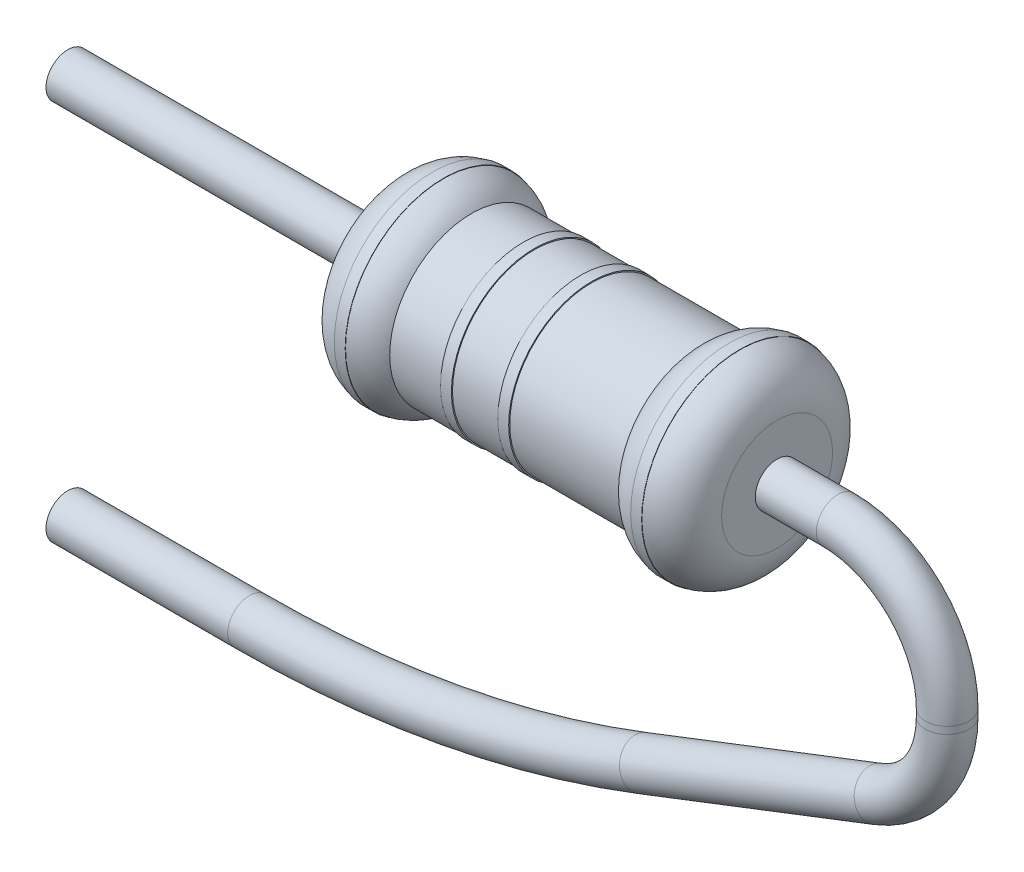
ISO-10303-21;
HEADER;
FILE_DESCRIPTION(('STEP AP214'),'2;1');
FILE_NAME('part.step','',(''),(''),'','','');
FILE_SCHEMA(('AUTOMOTIVE_DESIGN { 1 0 10303 214 1 1 1 1 }'));
ENDSEC;
DATA;
#1=APPLICATION_CONTEXT('core data for automotive mechanical design processes');
#2=APPLICATION_PROTOCOL_DEFINITION('international standard','automotive_design',2000,#1);
#3=PRODUCT_CONTEXT('',#1,'mechanical');
#4=PRODUCT('Part','Part','',(#3));
#5=PRODUCT_RELATED_PRODUCT_CATEGORY('part','',(#4));
#6=PRODUCT_DEFINITION_FORMATION('','',#4);
#7=PRODUCT_DEFINITION_CONTEXT('part definition',#1,'design');
#8=PRODUCT_DEFINITION('design','',#6,#7);
#9=PRODUCT_DEFINITION_SHAPE('','',#8);
#10=(LENGTH_UNIT() NAMED_UNIT(*) SI_UNIT(.MILLI.,.METRE.));
#11=(NAMED_UNIT(*) PLANE_ANGLE_UNIT() SI_UNIT($,.RADIAN.));
#12=(NAMED_UNIT(*) SI_UNIT($,.STERADIAN.) SOLID_ANGLE_UNIT());
#13=UNCERTAINTY_MEASURE_WITH_UNIT(LENGTH_MEASURE(1.E-05),#10,'distance_accuracy_value','');
#14=(GEOMETRIC_REPRESENTATION_CONTEXT(3) GLOBAL_UNCERTAINTY_ASSIGNED_CONTEXT((#13)) GLOBAL_UNIT_ASSIGNED_CONTEXT((#10,
#11,#12)) REPRESENTATION_CONTEXT('',''));
#15=CARTESIAN_POINT('',(0.,0.,0.));
#16=DIRECTION('',(0.,0.,1.));
#17=DIRECTION('',(1.,0.,0.));
#18=AXIS2_PLACEMENT_3D('',#15,#16,#17);
#19=CARTESIAN_POINT('',(1.75000000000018,0.,0.));
#20=DIRECTION('',(-1.,0.,0.));
#21=DIRECTION('',(0.,0.,1.));
#22=AXIS2_PLACEMENT_3D('',#19,#20,#21);
#23=PLANE('',#22);
#24=CARTESIAN_POINT('',(1.75000000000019,0.,0.));
#25=DIRECTION('',(-1.,0.,0.));
#26=DIRECTION('',(0.,0.,1.));
#27=AXIS2_PLACEMENT_3D('',#24,#25,#26);
#28=CIRCLE('',#27,0.508257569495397);
#29=CARTESIAN_POINT('',(1.75000000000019,0.,0.508257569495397));
#30=VERTEX_POINT('',#29);
#31=EDGE_CURVE('E36',#30,#30,#28,.T.);
#32=ORIENTED_EDGE('',*,*,#31,.F.);
#33=EDGE_LOOP('',(#32));
#34=FACE_BOUND('',#33,.T.);
#35=CARTESIAN_POINT('',(1.75000000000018,0.,0.));
#36=DIRECTION('',(1.,0.,0.));
#37=DIRECTION('',(0.,0.,-1.));
#38=AXIS2_PLACEMENT_3D('',#35,#36,#37);
#39=CIRCLE('',#38,0.2);
#40=CARTESIAN_POINT('',(1.75000000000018,0.,-0.2));
#41=VERTEX_POINT('',#40);
#42=EDGE_CURVE('E10',#41,#41,#39,.T.);
#43=ORIENTED_EDGE('',*,*,#42,.F.);
#44=EDGE_LOOP('',(#43));
#45=FACE_BOUND('',#44,.T.);
#46=ADVANCED_FACE('F24',(#34,#45),#23,.F.);
#47=CARTESIAN_POINT('',(-1.75000000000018,0.,0.));
#48=DIRECTION('',(1.,0.,0.));
#49=DIRECTION('',(0.,0.,-1.));
#50=AXIS2_PLACEMENT_3D('',#47,#48,#49);
#51=PLANE('',#50);
#52=CARTESIAN_POINT('',(-1.75000000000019,0.,0.));
#53=DIRECTION('',(-1.,0.,0.));
#54=DIRECTION('',(0.,0.,1.));
#55=AXIS2_PLACEMENT_3D('',#52,#53,#54);
#56=CIRCLE('',#55,0.508257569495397);
#57=CARTESIAN_POINT('',(-1.75000000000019,0.,0.508257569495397));
#58=VERTEX_POINT('',#57);
#59=EDGE_CURVE('E62',#58,#58,#56,.T.);
#60=ORIENTED_EDGE('',*,*,#59,.T.);
#61=EDGE_LOOP('',(#60));
#62=FACE_BOUND('',#61,.T.);
#63=CARTESIAN_POINT('',(-1.75000000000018,0.,0.));
#64=DIRECTION('',(1.,0.,0.));
#65=DIRECTION('',(0.,0.,-1.));
#66=AXIS2_PLACEMENT_3D('',#63,#64,#65);
#67=CIRCLE('',#66,0.2);
#68=CARTESIAN_POINT('',(-1.75000000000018,0.,-0.2));
#69=VERTEX_POINT('',#68);
#70=EDGE_CURVE('E28',#69,#69,#67,.F.);
#71=ORIENTED_EDGE('',*,*,#70,.F.);
#72=EDGE_LOOP('',(#71));
#73=FACE_BOUND('',#72,.T.);
#74=ADVANCED_FACE('F26',(#62,#73),#51,.F.);
#75=CARTESIAN_POINT('',(1.35825756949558,0.,0.));
#76=DIRECTION('',(-1.,0.,0.));
#77=DIRECTION('',(0.,0.,1.));
#78=AXIS2_PLACEMENT_3D('',#75,#76,#77);
#79=TOROIDAL_SURFACE('',#78,0.508257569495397,0.391742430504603);
#80=CARTESIAN_POINT('',(1.40825756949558,0.,0.));
#81=DIRECTION('',(-1.,0.,0.));
#82=DIRECTION('',(0.,0.,1.));
#83=AXIS2_PLACEMENT_3D('',#80,#81,#82);
#84=CIRCLE('',#83,0.896796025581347);
#85=CARTESIAN_POINT('',(1.40825756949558,0.,0.896796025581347));
#86=VERTEX_POINT('',#85);
#87=EDGE_CURVE('E116',#86,#86,#84,.T.);
#88=ORIENTED_EDGE('',*,*,#87,.F.);
#89=EDGE_LOOP('',(#88));
#90=FACE_BOUND('',#89,.T.);
#91=ORIENTED_EDGE('',*,*,#31,.T.);
#92=EDGE_LOOP('',(#91));
#93=FACE_BOUND('',#92,.T.);
#94=ADVANCED_FACE('F121',(#90,#93),#79,.T.);
#95=CARTESIAN_POINT('',(1.40825756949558,0.896796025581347,0.));
#96=DIRECTION('',(-1.,0.,0.));
#97=DIRECTION('',(0.,0.,1.));
#98=AXIS2_PLACEMENT_3D('',#95,#96,#97);
#99=PLANE('',#98);
#100=CARTESIAN_POINT('',(1.40825756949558,0.,0.));
#101=DIRECTION('',(-1.,0.,0.));
#102=DIRECTION('',(0.,0.,1.));
#103=AXIS2_PLACEMENT_3D('',#100,#101,#102);
#104=CIRCLE('',#103,0.900000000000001);
#105=CARTESIAN_POINT('',(1.40825756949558,0.,0.900000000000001));
#106=VERTEX_POINT('',#105);
#107=EDGE_CURVE('E113',#106,#106,#104,.T.);
#108=ORIENTED_EDGE('',*,*,#107,.F.);
#109=EDGE_LOOP('',(#108));
#110=FACE_BOUND('',#109,.T.);
#111=ORIENTED_EDGE('',*,*,#87,.T.);
#112=EDGE_LOOP('',(#111));
#113=FACE_BOUND('',#112,.T.);
#114=ADVANCED_FACE('F134',(#110,#113),#99,.F.);
#115=CARTESIAN_POINT('',(-9.42004899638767,0.,0.));
#116=DIRECTION('',(-1.,0.,0.));
#117=DIRECTION('',(0.,0.,1.));
#118=AXIS2_PLACEMENT_3D('',#115,#116,#117);
#119=CYLINDRICAL_SURFACE('',#118,0.900000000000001);
#120=CARTESIAN_POINT('',(1.30825756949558,0.,0.));
#121=DIRECTION('',(-1.,0.,0.));
#122=DIRECTION('',(0.,0.,1.));
#123=AXIS2_PLACEMENT_3D('',#120,#121,#122);
#124=CIRCLE('',#123,0.900000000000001);
#125=CARTESIAN_POINT('',(1.30825756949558,0.,0.900000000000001));
#126=VERTEX_POINT('',#125);
#127=EDGE_CURVE('E110',#126,#126,#124,.T.);
#128=ORIENTED_EDGE('',*,*,#127,.F.);
#129=EDGE_LOOP('',(#128));
#130=FACE_BOUND('',#129,.T.);
#131=ORIENTED_EDGE('',*,*,#107,.T.);
#132=EDGE_LOOP('',(#131));
#133=FACE_BOUND('',#132,.T.);
#134=ADVANCED_FACE('F138',(#130,#133),#119,.T.);
#135=CARTESIAN_POINT('',(1.30825756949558,0.896796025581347,0.));
#136=DIRECTION('',(1.,0.,0.));
#137=DIRECTION('',(0.,0.,-1.));
#138=AXIS2_PLACEMENT_3D('',#135,#136,#137);
#139=PLANE('',#138);
#140=CARTESIAN_POINT('',(1.30825756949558,0.,0.));
#141=DIRECTION('',(-1.,0.,0.));
#142=DIRECTION('',(0.,0.,1.));
#143=AXIS2_PLACEMENT_3D('',#140,#141,#142);
#144=CIRCLE('',#143,0.896796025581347);
#145=CARTESIAN_POINT('',(1.30825756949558,0.,0.896796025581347));
#146=VERTEX_POINT('',#145);
#147=EDGE_CURVE('E107',#146,#146,#144,.T.);
#148=ORIENTED_EDGE('',*,*,#147,.F.);
#149=EDGE_LOOP('',(#148));
#150=FACE_BOUND('',#149,.T.);
#151=ORIENTED_EDGE('',*,*,#127,.T.);
#152=EDGE_LOOP('',(#151));
#153=FACE_BOUND('',#152,.T.);
#154=ADVANCED_FACE('F142',(#150,#153),#139,.F.);
#155=CARTESIAN_POINT('',(1.35825756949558,0.,0.));
#156=DIRECTION('',(-1.,0.,0.));
#157=DIRECTION('',(0.,0.,1.));
#158=AXIS2_PLACEMENT_3D('',#155,#156,#157);
#159=TOROIDAL_SURFACE('',#158,0.508257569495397,0.391742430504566);
#160=CARTESIAN_POINT('',(1.04999999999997,0.,0.));
#161=DIRECTION('',(-1.,0.,0.));
#162=DIRECTION('',(0.,0.,1.));
#163=AXIS2_PLACEMENT_3D('',#160,#161,#162);
#164=CIRCLE('',#163,0.750000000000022);
#165=CARTESIAN_POINT('',(1.04999999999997,0.,0.750000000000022));
#166=VERTEX_POINT('',#165);
#167=EDGE_CURVE('E104',#166,#166,#164,.T.);
#168=ORIENTED_EDGE('',*,*,#167,.F.);
#169=EDGE_LOOP('',(#168));
#170=FACE_BOUND('',#169,.T.);
#171=ORIENTED_EDGE('',*,*,#147,.T.);
#172=EDGE_LOOP('',(#171));
#173=FACE_BOUND('',#172,.T.);
#174=ADVANCED_FACE('F146',(#170,#173),#159,.T.);
#175=CARTESIAN_POINT('',(-9.42004899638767,0.,0.));
#176=DIRECTION('',(-1.,0.,0.));
#177=DIRECTION('',(0.,0.,1.));
#178=AXIS2_PLACEMENT_3D('',#175,#176,#177);
#179=CYLINDRICAL_SURFACE('',#178,0.750000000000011);
#180=CARTESIAN_POINT('',(0.0499999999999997,0.,0.));
#181=DIRECTION('',(-1.,0.,0.));
#182=DIRECTION('',(0.,0.,1.));
#183=AXIS2_PLACEMENT_3D('',#180,#181,#182);
#184=CIRCLE('',#183,0.75);
#185=CARTESIAN_POINT('',(0.0499999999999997,0.,0.75));
#186=VERTEX_POINT('',#185);
#187=EDGE_CURVE('E101',#186,#186,#184,.T.);
#188=ORIENTED_EDGE('',*,*,#187,.F.);
#189=EDGE_LOOP('',(#188));
#190=FACE_BOUND('',#189,.T.);
#191=ORIENTED_EDGE('',*,*,#167,.T.);
#192=EDGE_LOOP('',(#191));
#193=FACE_BOUND('',#192,.T.);
#194=ADVANCED_FACE('F150',(#190,#193),#179,.T.);
#195=CARTESIAN_POINT('',(0.05,0.75,0.));
#196=DIRECTION('',(-1.,0.,0.));
#197=DIRECTION('',(0.,0.,1.));
#198=AXIS2_PLACEMENT_3D('',#195,#196,#197);
#199=PLANE('',#198);
#200=CARTESIAN_POINT('',(0.0499999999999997,0.,0.));
#201=DIRECTION('',(-1.,0.,0.));
#202=DIRECTION('',(0.,0.,1.));
#203=AXIS2_PLACEMENT_3D('',#200,#201,#202);
#204=CIRCLE('',#203,0.760000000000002);
#205=CARTESIAN_POINT('',(0.0499999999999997,0.,0.760000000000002));
#206=VERTEX_POINT('',#205);
#207=EDGE_CURVE('E98',#206,#206,#204,.T.);
#208=ORIENTED_EDGE('',*,*,#207,.F.);
#209=EDGE_LOOP('',(#208));
#210=FACE_BOUND('',#209,.T.);
#211=ORIENTED_EDGE('',*,*,#187,.T.);
#212=EDGE_LOOP('',(#211));
#213=FACE_BOUND('',#212,.T.);
#214=ADVANCED_FACE('F154',(#210,#213),#199,.F.);
#215=CARTESIAN_POINT('',(-9.42004899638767,0.,0.));
#216=DIRECTION('',(-1.,0.,0.));
#217=DIRECTION('',(0.,0.,1.));
#218=AXIS2_PLACEMENT_3D('',#215,#216,#217);
#219=CYLINDRICAL_SURFACE('',#218,0.760000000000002);
#220=CARTESIAN_POINT('',(-0.0499999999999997,0.,0.));
#221=DIRECTION('',(-1.,0.,0.));
#222=DIRECTION('',(0.,0.,1.));
#223=AXIS2_PLACEMENT_3D('',#220,#221,#222);
#224=CIRCLE('',#223,0.760000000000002);
#225=CARTESIAN_POINT('',(-0.0499999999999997,0.,0.760000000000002));
#226=VERTEX_POINT('',#225);
#227=EDGE_CURVE('E95',#226,#226,#224,.T.);
#228=ORIENTED_EDGE('',*,*,#227,.F.);
#229=EDGE_LOOP('',(#228));
#230=FACE_BOUND('',#229,.T.);
#231=ORIENTED_EDGE('',*,*,#207,.T.);
#232=EDGE_LOOP('',(#231));
#233=FACE_BOUND('',#232,.T.);
#234=ADVANCED_FACE('F158',(#230,#233),#219,.T.);
#235=CARTESIAN_POINT('',(-0.05,0.75,0.));
#236=DIRECTION('',(1.,0.,0.));
#237=DIRECTION('',(0.,0.,-1.));
#238=AXIS2_PLACEMENT_3D('',#235,#236,#237);
#239=PLANE('',#238);
#240=CARTESIAN_POINT('',(-0.0499999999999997,0.,0.));
#241=DIRECTION('',(-1.,0.,0.));
#242=DIRECTION('',(0.,0.,1.));
#243=AXIS2_PLACEMENT_3D('',#240,#241,#242);
#244=CIRCLE('',#243,0.75);
#245=CARTESIAN_POINT('',(-0.0499999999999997,0.,0.75));
#246=VERTEX_POINT('',#245);
#247=EDGE_CURVE('E92',#246,#246,#244,.T.);
#248=ORIENTED_EDGE('',*,*,#247,.F.);
#249=EDGE_LOOP('',(#248));
#250=FACE_BOUND('',#249,.T.);
#251=ORIENTED_EDGE('',*,*,#227,.T.);
#252=EDGE_LOOP('',(#251));
#253=FACE_BOUND('',#252,.T.);
#254=ADVANCED_FACE('F162',(#250,#253),#239,.F.);
#255=CARTESIAN_POINT('',(-9.42004899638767,0.,0.));
#256=DIRECTION('',(-1.,0.,0.));
#257=DIRECTION('',(0.,0.,1.));
#258=AXIS2_PLACEMENT_3D('',#255,#256,#257);
#259=CYLINDRICAL_SURFACE('',#258,0.750000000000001);
#260=CARTESIAN_POINT('',(-0.474999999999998,0.,0.));
#261=DIRECTION('',(-1.,0.,0.));
#262=DIRECTION('',(0.,0.,1.));
#263=AXIS2_PLACEMENT_3D('',#260,#261,#262);
#264=CIRCLE('',#263,0.750000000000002);
#265=CARTESIAN_POINT('',(-0.474999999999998,0.,0.750000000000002));
#266=VERTEX_POINT('',#265);
#267=EDGE_CURVE('E89',#266,#266,#264,.T.);
#268=ORIENTED_EDGE('',*,*,#267,.F.);
#269=EDGE_LOOP('',(#268));
#270=FACE_BOUND('',#269,.T.);
#271=ORIENTED_EDGE('',*,*,#247,.T.);
#272=EDGE_LOOP('',(#271));
#273=FACE_BOUND('',#272,.T.);
#274=ADVANCED_FACE('F166',(#270,#273),#259,.T.);
#275=CARTESIAN_POINT('',(-0.474999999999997,0.750000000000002,0.));
#276=DIRECTION('',(-1.,0.,0.));
#277=DIRECTION('',(0.,0.,1.));
#278=AXIS2_PLACEMENT_3D('',#275,#276,#277);
#279=PLANE('',#278);
#280=CARTESIAN_POINT('',(-0.474999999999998,0.,0.));
#281=DIRECTION('',(-1.,0.,0.));
#282=DIRECTION('',(0.,0.,1.));
#283=AXIS2_PLACEMENT_3D('',#280,#281,#282);
#284=CIRCLE('',#283,0.760000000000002);
#285=CARTESIAN_POINT('',(-0.474999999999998,0.,0.760000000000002));
#286=VERTEX_POINT('',#285);
#287=EDGE_CURVE('E86',#286,#286,#284,.T.);
#288=ORIENTED_EDGE('',*,*,#287,.F.);
#289=EDGE_LOOP('',(#288));
#290=FACE_BOUND('',#289,.T.);
#291=ORIENTED_EDGE('',*,*,#267,.T.);
#292=EDGE_LOOP('',(#291));
#293=FACE_BOUND('',#292,.T.);
#294=ADVANCED_FACE('F170',(#290,#293),#279,.F.);
#295=CARTESIAN_POINT('',(-9.42004899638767,0.,0.));
#296=DIRECTION('',(-1.,0.,0.));
#297=DIRECTION('',(0.,0.,1.));
#298=AXIS2_PLACEMENT_3D('',#295,#296,#297);
#299=CYLINDRICAL_SURFACE('',#298,0.760000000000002);
#300=CARTESIAN_POINT('',(-0.574999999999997,0.,0.));
#301=DIRECTION('',(-1.,0.,0.));
#302=DIRECTION('',(0.,0.,1.));
#303=AXIS2_PLACEMENT_3D('',#300,#301,#302);
#304=CIRCLE('',#303,0.760000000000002);
#305=CARTESIAN_POINT('',(-0.574999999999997,0.,0.760000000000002));
#306=VERTEX_POINT('',#305);
#307=EDGE_CURVE('E83',#306,#306,#304,.T.);
#308=ORIENTED_EDGE('',*,*,#307,.F.);
#309=EDGE_LOOP('',(#308));
#310=FACE_BOUND('',#309,.T.);
#311=ORIENTED_EDGE('',*,*,#287,.T.);
#312=EDGE_LOOP('',(#311));
#313=FACE_BOUND('',#312,.T.);
#314=ADVANCED_FACE('F174',(#310,#313),#299,.T.);
#315=CARTESIAN_POINT('',(-0.574999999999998,0.750000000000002,0.));
#316=DIRECTION('',(1.,0.,0.));
#317=DIRECTION('',(0.,0.,-1.));
#318=AXIS2_PLACEMENT_3D('',#315,#316,#317);
#319=PLANE('',#318);
#320=CARTESIAN_POINT('',(-0.574999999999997,0.,0.));
#321=DIRECTION('',(-1.,0.,0.));
#322=DIRECTION('',(0.,0.,1.));
#323=AXIS2_PLACEMENT_3D('',#320,#321,#322);
#324=CIRCLE('',#323,0.750000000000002);
#325=CARTESIAN_POINT('',(-0.574999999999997,0.,0.750000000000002));
#326=VERTEX_POINT('',#325);
#327=EDGE_CURVE('E80',#326,#326,#324,.T.);
#328=ORIENTED_EDGE('',*,*,#327,.F.);
#329=EDGE_LOOP('',(#328));
#330=FACE_BOUND('',#329,.T.);
#331=ORIENTED_EDGE('',*,*,#307,.T.);
#332=EDGE_LOOP('',(#331));
#333=FACE_BOUND('',#332,.T.);
#334=ADVANCED_FACE('F178',(#330,#333),#319,.F.);
#335=CARTESIAN_POINT('',(-9.42004899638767,0.,0.));
#336=DIRECTION('',(-1.,0.,0.));
#337=DIRECTION('',(0.,0.,1.));
#338=AXIS2_PLACEMENT_3D('',#335,#336,#337);
#339=CYLINDRICAL_SURFACE('',#338,0.750000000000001);
#340=CARTESIAN_POINT('',(-1.05,0.,0.));
#341=DIRECTION('',(-1.,0.,0.));
#342=DIRECTION('',(0.,0.,1.));
#343=AXIS2_PLACEMENT_3D('',#340,#341,#342);
#344=CIRCLE('',#343,0.75);
#345=CARTESIAN_POINT('',(-1.05,0.,0.75));
#346=VERTEX_POINT('',#345);
#347=EDGE_CURVE('E77',#346,#346,#344,.T.);
#348=ORIENTED_EDGE('',*,*,#347,.F.);
#349=EDGE_LOOP('',(#348));
#350=FACE_BOUND('',#349,.T.);
#351=ORIENTED_EDGE('',*,*,#327,.T.);
#352=EDGE_LOOP('',(#351));
#353=FACE_BOUND('',#352,.T.);
#354=ADVANCED_FACE('F182',(#350,#353),#339,.T.);
#355=CARTESIAN_POINT('',(-1.35825756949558,0.,0.));
#356=DIRECTION('',(-1.,0.,0.));
#357=DIRECTION('',(0.,0.,1.));
#358=AXIS2_PLACEMENT_3D('',#355,#356,#357);
#359=TOROIDAL_SURFACE('',#358,0.508257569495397,0.391742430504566);
#360=CARTESIAN_POINT('',(-1.30825756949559,0.,0.));
#361=DIRECTION('',(-1.,0.,0.));
#362=DIRECTION('',(0.,0.,1.));
#363=AXIS2_PLACEMENT_3D('',#360,#361,#362);
#364=CIRCLE('',#363,0.896796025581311);
#365=CARTESIAN_POINT('',(-1.30825756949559,0.,0.896796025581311));
#366=VERTEX_POINT('',#365);
#367=EDGE_CURVE('E74',#366,#366,#364,.T.);
#368=ORIENTED_EDGE('',*,*,#367,.F.);
#369=EDGE_LOOP('',(#368));
#370=FACE_BOUND('',#369,.T.);
#371=ORIENTED_EDGE('',*,*,#347,.T.);
#372=EDGE_LOOP('',(#371));
#373=FACE_BOUND('',#372,.T.);
#374=ADVANCED_FACE('F186',(#370,#373),#359,.T.);
#375=CARTESIAN_POINT('',(-1.30825756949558,0.896796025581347,0.));
#376=DIRECTION('',(-1.,0.,0.));
#377=DIRECTION('',(0.,0.,1.));
#378=AXIS2_PLACEMENT_3D('',#375,#376,#377);
#379=PLANE('',#378);
#380=CARTESIAN_POINT('',(-1.30825756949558,0.,0.));
#381=DIRECTION('',(-1.,0.,0.));
#382=DIRECTION('',(0.,0.,1.));
#383=AXIS2_PLACEMENT_3D('',#380,#381,#382);
#384=CIRCLE('',#383,0.900000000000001);
#385=CARTESIAN_POINT('',(-1.30825756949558,0.,0.900000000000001));
#386=VERTEX_POINT('',#385);
#387=EDGE_CURVE('E71',#386,#386,#384,.T.);
#388=ORIENTED_EDGE('',*,*,#387,.F.);
#389=EDGE_LOOP('',(#388));
#390=FACE_BOUND('',#389,.T.);
#391=ORIENTED_EDGE('',*,*,#367,.T.);
#392=EDGE_LOOP('',(#391));
#393=FACE_BOUND('',#392,.T.);
#394=ADVANCED_FACE('F190',(#390,#393),#379,.F.);
#395=CARTESIAN_POINT('',(-9.42004899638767,0.,0.));
#396=DIRECTION('',(-1.,0.,0.));
#397=DIRECTION('',(0.,0.,1.));
#398=AXIS2_PLACEMENT_3D('',#395,#396,#397);
#399=CYLINDRICAL_SURFACE('',#398,0.900000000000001);
#400=CARTESIAN_POINT('',(-1.40825756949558,0.,0.));
#401=DIRECTION('',(-1.,0.,0.));
#402=DIRECTION('',(0.,0.,1.));
#403=AXIS2_PLACEMENT_3D('',#400,#401,#402);
#404=CIRCLE('',#403,0.900000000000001);
#405=CARTESIAN_POINT('',(-1.40825756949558,0.,0.900000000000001));
#406=VERTEX_POINT('',#405);
#407=EDGE_CURVE('E68',#406,#406,#404,.T.);
#408=ORIENTED_EDGE('',*,*,#407,.F.);
#409=EDGE_LOOP('',(#408));
#410=FACE_BOUND('',#409,.T.);
#411=ORIENTED_EDGE('',*,*,#387,.T.);
#412=EDGE_LOOP('',(#411));
#413=FACE_BOUND('',#412,.T.);
#414=ADVANCED_FACE('F194',(#410,#413),#399,.T.);
#415=CARTESIAN_POINT('',(-1.40825756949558,0.896796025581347,0.));
#416=DIRECTION('',(1.,0.,0.));
#417=DIRECTION('',(0.,0.,-1.));
#418=AXIS2_PLACEMENT_3D('',#415,#416,#417);
#419=PLANE('',#418);
#420=CARTESIAN_POINT('',(-1.40825756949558,0.,0.));
#421=DIRECTION('',(-1.,0.,0.));
#422=DIRECTION('',(0.,0.,1.));
#423=AXIS2_PLACEMENT_3D('',#420,#421,#422);
#424=CIRCLE('',#423,0.896796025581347);
#425=CARTESIAN_POINT('',(-1.40825756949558,0.,0.896796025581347));
#426=VERTEX_POINT('',#425);
#427=EDGE_CURVE('E65',#426,#426,#424,.T.);
#428=ORIENTED_EDGE('',*,*,#427,.F.);
#429=EDGE_LOOP('',(#428));
#430=FACE_BOUND('',#429,.T.);
#431=ORIENTED_EDGE('',*,*,#407,.T.);
#432=EDGE_LOOP('',(#431));
#433=FACE_BOUND('',#432,.T.);
#434=ADVANCED_FACE('F198',(#430,#433),#419,.F.);
#435=CARTESIAN_POINT('',(-1.35825756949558,0.,0.));
#436=DIRECTION('',(-1.,0.,0.));
#437=DIRECTION('',(0.,0.,1.));
#438=AXIS2_PLACEMENT_3D('',#435,#436,#437);
#439=TOROIDAL_SURFACE('',#438,0.508257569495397,0.391742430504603);
#440=ORIENTED_EDGE('',*,*,#59,.F.);
#441=EDGE_LOOP('',(#440));
#442=FACE_BOUND('',#441,.T.);
#443=ORIENTED_EDGE('',*,*,#427,.T.);
#444=EDGE_LOOP('',(#443));
#445=FACE_BOUND('',#444,.T.);
#446=ADVANCED_FACE('F202',(#442,#445),#439,.T.);
#447=CARTESIAN_POINT('',(-4.75000000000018,0.,0.));
#448=DIRECTION('',(1.,0.,0.));
#449=DIRECTION('',(0.,0.,-1.));
#450=AXIS2_PLACEMENT_3D('',#447,#448,#449);
#451=CYLINDRICAL_SURFACE('',#450,0.2);
#452=CARTESIAN_POINT('',(-4.75000000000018,0.,0.));
#453=DIRECTION('',(-1.,0.,0.));
#454=DIRECTION('',(0.,0.,1.));
#455=AXIS2_PLACEMENT_3D('',#452,#453,#454);
#456=CIRCLE('',#455,0.2);
#457=CARTESIAN_POINT('',(-4.75000000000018,0.,0.2));
#458=VERTEX_POINT('',#457);
#459=EDGE_CURVE('E59',#458,#458,#456,.T.);
#460=ORIENTED_EDGE('',*,*,#459,.F.);
#461=EDGE_LOOP('',(#460));
#462=FACE_BOUND('',#461,.T.);
#463=ORIENTED_EDGE('',*,*,#70,.T.);
#464=EDGE_LOOP('',(#463));
#465=FACE_BOUND('',#464,.T.);
#466=ADVANCED_FACE('F206',(#462,#465),#451,.T.);
#467=CARTESIAN_POINT('',(-4.75000000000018,0.,0.));
#468=DIRECTION('',(-1.,0.,0.));
#469=DIRECTION('',(0.,0.,1.));
#470=AXIS2_PLACEMENT_3D('',#467,#468,#469);
#471=PLANE('',#470);
#472=ORIENTED_EDGE('',*,*,#459,.T.);
#473=EDGE_LOOP('',(#472));
#474=FACE_BOUND('',#473,.T.);
#475=ADVANCED_FACE('F210',(#474),#471,.T.);
#476=CARTESIAN_POINT('',(-3.08528875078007,-3.5,0.));
#477=DIRECTION('',(-1.,0.,0.));
#478=DIRECTION('',(0.,0.,1.));
#479=AXIS2_PLACEMENT_3D('',#476,#477,#478);
#480=CYLINDRICAL_SURFACE('',#479,0.2);
#481=CARTESIAN_POINT('',(-3.08528875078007,-3.5,0.));
#482=DIRECTION('',(-1.,0.,0.));
#483=DIRECTION('',(0.,0.,-1.));
#484=AXIS2_PLACEMENT_3D('',#481,#482,#483);
#485=CIRCLE('',#484,0.2);
#486=CARTESIAN_POINT('',(-3.08528875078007,-3.7,0.));
#487=VERTEX_POINT('',#486);
#488=EDGE_CURVE('E53',#487,#487,#485,.T.);
#489=ORIENTED_EDGE('',*,*,#488,.T.);
#490=EDGE_LOOP('',(#489));
#491=FACE_BOUND('',#490,.T.);
#492=CARTESIAN_POINT('',(-4.75000000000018,-3.5,0.));
#493=DIRECTION('',(-1.,0.,0.));
#494=DIRECTION('',(0.,0.,-1.));
#495=AXIS2_PLACEMENT_3D('',#492,#493,#494);
#496=CIRCLE('',#495,0.2);
#497=CARTESIAN_POINT('',(-4.75000000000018,-3.5,-0.2));
#498=VERTEX_POINT('',#497);
#499=EDGE_CURVE('E56',#498,#498,#496,.T.);
#500=ORIENTED_EDGE('',*,*,#499,.F.);
#501=EDGE_LOOP('',(#500));
#502=FACE_BOUND('',#501,.T.);
#503=ADVANCED_FACE('F213',(#491,#502),#480,.T.);
#504=CARTESIAN_POINT('',(-3.08528875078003,6.5,0.));
#505=DIRECTION('',(0.,0.,-1.));
#506=DIRECTION('',(-1.,0.,0.));
#507=AXIS2_PLACEMENT_3D('',#504,#505,#506);
#508=TOROIDAL_SURFACE('',#507,10.,0.2);
#509=CARTESIAN_POINT('',(0.518729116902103,-2.82797165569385,0.));
#510=DIRECTION('',(-0.932797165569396,-0.360401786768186,0.));
#511=DIRECTION('',(0.,0.,-1.));
#512=AXIS2_PLACEMENT_3D('',#509,#510,#511);
#513=CIRCLE('',#512,0.2);
#514=CARTESIAN_POINT('',(0.590809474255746,-3.01453108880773,0.));
#515=VERTEX_POINT('',#514);
#516=EDGE_CURVE('E50',#515,#515,#513,.T.);
#517=CARTESIAN_POINT('',(-3.08528875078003,6.5,0.));
#518=DIRECTION('',(0.,0.,-1.));
#519=DIRECTION('',(-1.,0.,0.));
#520=AXIS2_PLACEMENT_3D('',#517,#518,#519);
#521=CIRCLE('',#520,10.2);
#522=EDGE_CURVE('',#515,#487,#521,.T.);
#523=ORIENTED_EDGE('',*,*,#516,.T.);
#524=ORIENTED_EDGE('',*,*,#488,.F.);
#525=ORIENTED_EDGE('',*,*,#522,.T.);
#526=ORIENTED_EDGE('',*,*,#522,.F.);
#527=EDGE_LOOP('',(#523,#525,#524,#526));
#528=FACE_BOUND('',#527,.T.);
#529=ADVANCED_FACE('F216',(#528),#508,.T.);
#530=CARTESIAN_POINT('',(2.66915287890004,-1.99711946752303,0.));
#531=DIRECTION('',(-0.932797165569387,-0.360401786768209,0.));
#532=DIRECTION('',(0.360401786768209,-0.932797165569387,0.));
#533=AXIS2_PLACEMENT_3D('',#530,#531,#532);
#534=CYLINDRICAL_SURFACE('',#533,0.2);
#535=CARTESIAN_POINT('',(2.66915287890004,-1.99711946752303,0.));
#536=DIRECTION('',(-0.932797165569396,-0.360401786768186,0.));
#537=DIRECTION('',(0.,0.,-1.));
#538=AXIS2_PLACEMENT_3D('',#535,#536,#537);
#539=CIRCLE('',#538,0.2);
#540=CARTESIAN_POINT('',(2.74123323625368,-2.1836789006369,0.));
#541=VERTEX_POINT('',#540);
#542=EDGE_CURVE('E47',#541,#541,#539,.T.);
#543=ORIENTED_EDGE('',*,*,#542,.T.);
#544=EDGE_LOOP('',(#543));
#545=FACE_BOUND('',#544,.T.);
#546=ORIENTED_EDGE('',*,*,#516,.F.);
#547=EDGE_LOOP('',(#546));
#548=FACE_BOUND('',#547,.T.);
#549=ADVANCED_FACE('F220',(#545,#548),#534,.T.);
#550=CARTESIAN_POINT('',(2.30875109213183,-1.06432230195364,0.));
#551=DIRECTION('',(0.,0.,-1.));
#552=DIRECTION('',(-1.,0.,0.));
#553=AXIS2_PLACEMENT_3D('',#550,#551,#552);
#554=TOROIDAL_SURFACE('',#553,1.,0.2);
#555=CARTESIAN_POINT('',(3.30875109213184,-1.06432230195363,0.));
#556=DIRECTION('',(0.,-1.,0.));
#557=DIRECTION('',(0.,0.,-1.));
#558=AXIS2_PLACEMENT_3D('',#555,#556,#557);
#559=CIRCLE('',#558,0.2);
#560=CARTESIAN_POINT('',(3.50875109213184,-1.06432230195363,0.));
#561=VERTEX_POINT('',#560);
#562=EDGE_CURVE('E44',#561,#561,#559,.T.);
#563=CARTESIAN_POINT('',(2.30875109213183,-1.06432230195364,0.));
#564=DIRECTION('',(0.,0.,-1.));
#565=DIRECTION('',(-1.,0.,0.));
#566=AXIS2_PLACEMENT_3D('',#563,#564,#565);
#567=CIRCLE('',#566,1.2);
#568=EDGE_CURVE('',#561,#541,#567,.T.);
#569=ORIENTED_EDGE('',*,*,#562,.T.);
#570=ORIENTED_EDGE('',*,*,#542,.F.);
#571=ORIENTED_EDGE('',*,*,#568,.T.);
#572=ORIENTED_EDGE('',*,*,#568,.F.);
#573=EDGE_LOOP('',(#569,#571,#570,#572));
#574=FACE_BOUND('',#573,.T.);
#575=ADVANCED_FACE('F224',(#574),#554,.T.);
#576=CARTESIAN_POINT('',(3.30875109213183,-1.00000000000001,0.));
#577=DIRECTION('',(0.,-1.,0.));
#578=DIRECTION('',(1.,0.,0.));
#579=AXIS2_PLACEMENT_3D('',#576,#577,#578);
#580=CYLINDRICAL_SURFACE('',#579,0.2);
#581=CARTESIAN_POINT('',(3.30875109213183,-1.00000000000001,0.));
#582=DIRECTION('',(0.,-1.,0.));
#583=DIRECTION('',(0.,0.,-1.));
#584=AXIS2_PLACEMENT_3D('',#581,#582,#583);
#585=CIRCLE('',#584,0.2);
#586=CARTESIAN_POINT('',(3.50875109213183,-1.00000000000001,0.));
#587=VERTEX_POINT('',#586);
#588=EDGE_CURVE('E41',#587,#587,#585,.T.);
#589=ORIENTED_EDGE('',*,*,#588,.T.);
#590=EDGE_LOOP('',(#589));
#591=FACE_BOUND('',#590,.T.);
#592=ORIENTED_EDGE('',*,*,#562,.F.);
#593=EDGE_LOOP('',(#592));
#594=FACE_BOUND('',#593,.T.);
#595=ADVANCED_FACE('F228',(#591,#594),#580,.T.);
#596=CARTESIAN_POINT('',(2.30875109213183,-1.,0.));
#597=DIRECTION('',(0.,0.,-1.));
#598=DIRECTION('',(-1.,0.,0.));
#599=AXIS2_PLACEMENT_3D('',#596,#597,#598);
#600=TOROIDAL_SURFACE('',#599,1.,0.2);
#601=CARTESIAN_POINT('',(2.30875109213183,0.,0.));
#602=DIRECTION('',(1.,0.,0.));
#603=DIRECTION('',(0.,0.,-1.));
#604=AXIS2_PLACEMENT_3D('',#601,#602,#603);
#605=CIRCLE('',#604,0.2);
#606=CARTESIAN_POINT('',(2.30875109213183,0.2,0.));
#607=VERTEX_POINT('',#606);
#608=EDGE_CURVE('E38',#607,#607,#605,.T.);
#609=CARTESIAN_POINT('',(2.30875109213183,-1.,0.));
#610=DIRECTION('',(0.,0.,-1.));
#611=DIRECTION('',(-1.,0.,0.));
#612=AXIS2_PLACEMENT_3D('',#609,#610,#611);
#613=CIRCLE('',#612,1.2);
#614=EDGE_CURVE('',#607,#587,#613,.T.);
#615=ORIENTED_EDGE('',*,*,#608,.T.);
#616=ORIENTED_EDGE('',*,*,#588,.F.);
#617=ORIENTED_EDGE('',*,*,#614,.T.);
#618=ORIENTED_EDGE('',*,*,#614,.F.);
#619=EDGE_LOOP('',(#615,#617,#616,#618));
#620=FACE_BOUND('',#619,.T.);
#621=ADVANCED_FACE('F232',(#620),#600,.T.);
#622=CARTESIAN_POINT('',(2.30875109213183,0.,0.));
#623=DIRECTION('',(-1.,0.,0.));
#624=DIRECTION('',(0.,-1.,0.));
#625=AXIS2_PLACEMENT_3D('',#622,#623,#624);
#626=CYLINDRICAL_SURFACE('',#625,0.2);
#627=ORIENTED_EDGE('',*,*,#608,.F.);
#628=EDGE_LOOP('',(#627));
#629=FACE_BOUND('',#628,.T.);
#630=ORIENTED_EDGE('',*,*,#42,.T.);
#631=EDGE_LOOP('',(#630));
#632=FACE_BOUND('',#631,.T.);
#633=ADVANCED_FACE('F236',(#629,#632),#626,.T.);
#634=CARTESIAN_POINT('',(-4.75000000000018,-3.5,0.));
#635=DIRECTION('',(-1.,0.,0.));
#636=DIRECTION('',(0.,0.,-1.));
#637=AXIS2_PLACEMENT_3D('',#634,#635,#636);
#638=PLANE('',#637);
#639=ORIENTED_EDGE('',*,*,#499,.T.);
#640=EDGE_LOOP('',(#639));
#641=FACE_BOUND('',#640,.T.);
#642=ADVANCED_FACE('F240',(#641),#638,.T.);
#643=CLOSED_SHELL('',(#46,#74,#94,#114,#134,#154,#174,#194,#214,#234,#254,#274,#294,#314,#334,
#354,#374,#394,#414,#434,#446,#466,#475,#503,#529,#549,#575,#595,#621,#633,#642));
#644=MANIFOLD_SOLID_BREP('B2',#643);
#645=ADVANCED_BREP_SHAPE_REPRESENTATION('',(#18,#644),#14);
#646=SHAPE_DEFINITION_REPRESENTATION(#9,#645);
ENDSEC;
END-ISO-10303-21;
